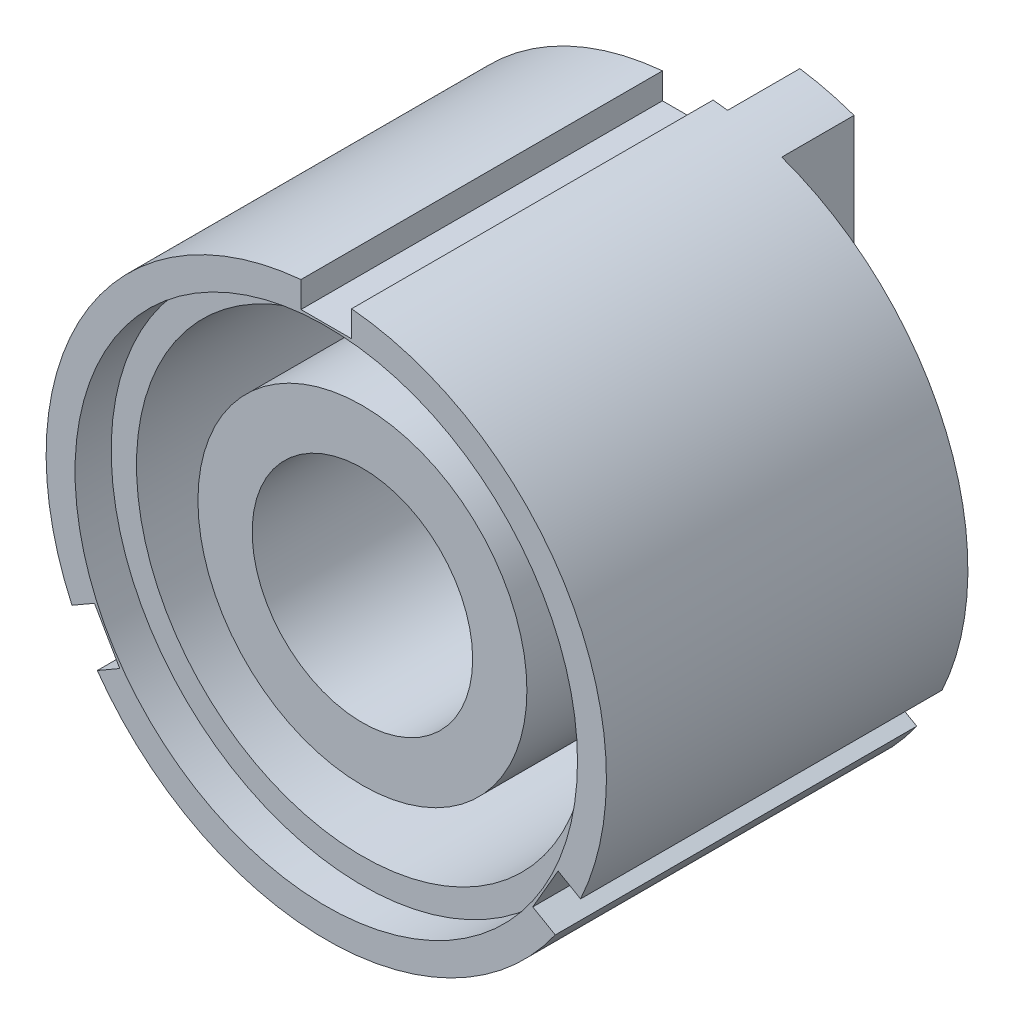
ISO-10303-21;
HEADER;
FILE_DESCRIPTION(('STEP AP214'),'2;1');
FILE_NAME('part.step','',(''),(''),'','','');
FILE_SCHEMA(('AUTOMOTIVE_DESIGN { 1 0 10303 214 1 1 1 1 }'));
ENDSEC;
DATA;
#1=APPLICATION_CONTEXT('core data for automotive mechanical design processes');
#2=APPLICATION_PROTOCOL_DEFINITION('international standard','automotive_design',2000,#1);
#3=PRODUCT_CONTEXT('',#1,'mechanical');
#4=PRODUCT('Part','Part','',(#3));
#5=PRODUCT_RELATED_PRODUCT_CATEGORY('part','',(#4));
#6=PRODUCT_DEFINITION_FORMATION('','',#4);
#7=PRODUCT_DEFINITION_CONTEXT('part definition',#1,'design');
#8=PRODUCT_DEFINITION('design','',#6,#7);
#9=PRODUCT_DEFINITION_SHAPE('','',#8);
#10=(LENGTH_UNIT() NAMED_UNIT(*) SI_UNIT(.MILLI.,.METRE.));
#11=(NAMED_UNIT(*) PLANE_ANGLE_UNIT() SI_UNIT($,.RADIAN.));
#12=(NAMED_UNIT(*) SI_UNIT($,.STERADIAN.) SOLID_ANGLE_UNIT());
#13=UNCERTAINTY_MEASURE_WITH_UNIT(LENGTH_MEASURE(1.E-05),#10,'distance_accuracy_value','');
#14=(GEOMETRIC_REPRESENTATION_CONTEXT(3) GLOBAL_UNCERTAINTY_ASSIGNED_CONTEXT((#13)) GLOBAL_UNIT_ASSIGNED_CONTEXT((#10,
#11,#12)) REPRESENTATION_CONTEXT('',''));
#15=CARTESIAN_POINT('',(0.,0.,0.));
#16=DIRECTION('',(0.,0.,1.));
#17=DIRECTION('',(1.,0.,0.));
#18=AXIS2_PLACEMENT_3D('',#15,#16,#17);
#19=CARTESIAN_POINT('',(0.,0.,0.));
#20=DIRECTION('',(0.,0.,1.));
#21=DIRECTION('',(1.,0.,0.));
#22=AXIS2_PLACEMENT_3D('',#19,#20,#21);
#23=PLANE('',#22);
#24=CARTESIAN_POINT('',(0.,0.,0.));
#25=DIRECTION('',(0.,0.,1.));
#26=DIRECTION('',(1.,0.,0.));
#27=AXIS2_PLACEMENT_3D('',#24,#25,#26);
#28=CIRCLE('',#27,3.05);
#29=CARTESIAN_POINT('',(3.05,0.,0.));
#30=VERTEX_POINT('',#29);
#31=EDGE_CURVE('E200',#30,#30,#28,.T.);
#32=ORIENTED_EDGE('',*,*,#31,.T.);
#33=EDGE_LOOP('',(#32));
#34=FACE_BOUND('',#33,.T.);
#35=DIRECTION('',(0.,1.,0.));
#36=VECTOR('',#35,1.);
#37=CARTESIAN_POINT('',(-2.60000000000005,-7.30085611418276,0.));
#38=LINE('',#37,#36);
#39=CARTESIAN_POINT('',(-2.60000000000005,-7.30085611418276,0.));
#40=VERTEX_POINT('',#39);
#41=CARTESIAN_POINT('',(-2.60000000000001,-1.6881943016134,0.));
#42=VERTEX_POINT('',#41);
#43=EDGE_CURVE('E174',#40,#42,#38,.T.);
#44=ORIENTED_EDGE('',*,*,#43,.F.);
#45=CARTESIAN_POINT('',(0.,0.,0.));
#46=DIRECTION('',(0.,0.,1.));
#47=DIRECTION('',(1.,0.,0.));
#48=AXIS2_PLACEMENT_3D('',#45,#46,#47);
#49=CIRCLE('',#48,7.75);
#50=CARTESIAN_POINT('',(-6.33426323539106,-4.46537896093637,0.));
#51=VERTEX_POINT('',#50);
#52=EDGE_CURVE('E185',#51,#40,#49,.T.);
#53=ORIENTED_EDGE('',*,*,#52,.F.);
#54=DIRECTION('',(0.866025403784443,0.499999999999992,0.));
#55=VECTOR('',#54,1.);
#56=CARTESIAN_POINT('',(-6.33426323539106,-4.46537896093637,0.));
#57=LINE('',#56,#55);
#58=CARTESIAN_POINT('',(-5.71217782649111,-4.10621778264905,0.));
#59=VERTEX_POINT('',#58);
#60=EDGE_CURVE('E415',#51,#59,#57,.T.);
#61=ORIENTED_EDGE('',*,*,#60,.T.);
#62=DIRECTION('',(-0.499999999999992,0.866025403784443,0.));
#63=VECTOR('',#62,1.);
#64=CARTESIAN_POINT('',(-5.71217782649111,-4.10621778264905,0.));
#65=LINE('',#64,#63);
#66=CARTESIAN_POINT('',(-6.4121778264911,-2.89378221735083,0.));
#67=VERTEX_POINT('',#66);
#68=EDGE_CURVE('E417',#59,#67,#65,.T.);
#69=ORIENTED_EDGE('',*,*,#68,.T.);
#70=DIRECTION('',(-0.866025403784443,-0.499999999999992,0.));
#71=VECTOR('',#70,1.);
#72=CARTESIAN_POINT('',(-7.03426323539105,-3.25294339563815,0.));
#73=LINE('',#72,#71);
#74=CARTESIAN_POINT('',(-7.03426323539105,-3.25294339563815,0.));
#75=VERTEX_POINT('',#74);
#76=EDGE_CURVE('E412',#67,#75,#73,.T.);
#77=ORIENTED_EDGE('',*,*,#76,.T.);
#78=CARTESIAN_POINT('',(-0.7,7.71832235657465,0.));
#79=VERTEX_POINT('',#78);
#80=EDGE_CURVE('E193',#79,#75,#49,.T.);
#81=ORIENTED_EDGE('',*,*,#80,.F.);
#82=DIRECTION('',(0.,-1.,0.));
#83=VECTOR('',#82,1.);
#84=CARTESIAN_POINT('',(-0.7,7.71832235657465,0.));
#85=LINE('',#84,#83);
#86=CARTESIAN_POINT('',(-0.7,7.,0.));
#87=VERTEX_POINT('',#86);
#88=EDGE_CURVE('E468',#79,#87,#85,.T.);
#89=ORIENTED_EDGE('',*,*,#88,.T.);
#90=DIRECTION('',(1.,0.,0.));
#91=VECTOR('',#90,1.);
#92=CARTESIAN_POINT('',(-0.7,7.,0.));
#93=LINE('',#92,#91);
#94=CARTESIAN_POINT('',(0.7,7.,0.));
#95=VERTEX_POINT('',#94);
#96=EDGE_CURVE('E471',#87,#95,#93,.T.);
#97=ORIENTED_EDGE('',*,*,#96,.T.);
#98=DIRECTION('',(0.,1.,0.));
#99=VECTOR('',#98,1.);
#100=CARTESIAN_POINT('',(0.7,7.71832235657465,0.));
#101=LINE('',#100,#99);
#102=CARTESIAN_POINT('',(0.700000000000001,7.71832235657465,0.));
#103=VERTEX_POINT('',#102);
#104=EDGE_CURVE('E465',#95,#103,#101,.T.);
#105=ORIENTED_EDGE('',*,*,#104,.T.);
#106=CARTESIAN_POINT('',(1.1,7.6715383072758,0.));
#107=VERTEX_POINT('',#106);
#108=EDGE_CURVE('E205',#107,#103,#49,.T.);
#109=ORIENTED_EDGE('',*,*,#108,.F.);
#110=DIRECTION('',(0.,1.,0.));
#111=VECTOR('',#110,1.);
#112=CARTESIAN_POINT('',(1.1,7.6715383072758,0.));
#113=LINE('',#112,#111);
#114=CARTESIAN_POINT('',(1.1,2.89827534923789,0.));
#115=VERTEX_POINT('',#114);
#116=EDGE_CURVE('E56',#115,#107,#113,.T.);
#117=ORIENTED_EDGE('',*,*,#116,.F.);
#118=CARTESIAN_POINT('',(0.,0.,0.));
#119=DIRECTION('',(0.,0.,1.));
#120=DIRECTION('',(-1.,0.,0.));
#121=AXIS2_PLACEMENT_3D('',#118,#119,#120);
#122=CIRCLE('',#121,3.1);
#123=CARTESIAN_POINT('',(2.6,1.68819430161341,0.));
#124=VERTEX_POINT('',#123);
#125=EDGE_CURVE('E376',#124,#115,#122,.T.);
#126=ORIENTED_EDGE('',*,*,#125,.F.);
#127=DIRECTION('',(0.,-1.,0.));
#128=VECTOR('',#127,1.);
#129=CARTESIAN_POINT('',(2.6,7.30085611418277,0.));
#130=LINE('',#129,#128);
#131=CARTESIAN_POINT('',(2.6,7.30085611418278,0.));
#132=VERTEX_POINT('',#131);
#133=EDGE_CURVE('E179',#132,#124,#130,.T.);
#134=ORIENTED_EDGE('',*,*,#133,.F.);
#135=CARTESIAN_POINT('',(7.034263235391,-3.25294339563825,0.));
#136=VERTEX_POINT('',#135);
#137=EDGE_CURVE('E197',#136,#132,#49,.T.);
#138=ORIENTED_EDGE('',*,*,#137,.F.);
#139=DIRECTION('',(-0.866025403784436,0.500000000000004,0.));
#140=VECTOR('',#139,1.);
#141=CARTESIAN_POINT('',(7.034263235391,-3.25294339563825,0.));
#142=LINE('',#141,#140);
#143=CARTESIAN_POINT('',(6.41217782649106,-2.89378221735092,0.));
#144=VERTEX_POINT('',#143);
#145=EDGE_CURVE('E440',#136,#144,#142,.T.);
#146=ORIENTED_EDGE('',*,*,#145,.T.);
#147=DIRECTION('',(-0.500000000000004,-0.866025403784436,0.));
#148=VECTOR('',#147,1.);
#149=CARTESIAN_POINT('',(6.41217782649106,-2.89378221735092,0.));
#150=LINE('',#149,#148);
#151=CARTESIAN_POINT('',(5.71217782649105,-4.10621778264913,0.));
#152=VERTEX_POINT('',#151);
#153=EDGE_CURVE('E443',#144,#152,#150,.T.);
#154=ORIENTED_EDGE('',*,*,#153,.T.);
#155=DIRECTION('',(0.866025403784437,-0.500000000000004,0.));
#156=VECTOR('',#155,1.);
#157=CARTESIAN_POINT('',(6.334263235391,-4.46537896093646,0.));
#158=LINE('',#157,#156);
#159=CARTESIAN_POINT('',(6.334263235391,-4.46537896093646,0.));
#160=VERTEX_POINT('',#159);
#161=EDGE_CURVE('E437',#152,#160,#158,.T.);
#162=ORIENTED_EDGE('',*,*,#161,.T.);
#163=CARTESIAN_POINT('',(-1.10000000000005,-7.67153830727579,0.));
#164=VERTEX_POINT('',#163);
#165=EDGE_CURVE('E194',#164,#160,#49,.T.);
#166=ORIENTED_EDGE('',*,*,#165,.F.);
#167=DIRECTION('',(0.,-1.,0.));
#168=VECTOR('',#167,1.);
#169=CARTESIAN_POINT('',(-1.10000000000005,-7.67153830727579,0.));
#170=LINE('',#169,#168);
#171=CARTESIAN_POINT('',(-1.10000000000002,-2.89827534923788,0.));
#172=VERTEX_POINT('',#171);
#173=EDGE_CURVE('E362',#172,#164,#170,.T.);
#174=ORIENTED_EDGE('',*,*,#173,.F.);
#175=CARTESIAN_POINT('',(0.,0.,0.));
#176=DIRECTION('',(0.,0.,1.));
#177=DIRECTION('',(1.,0.,0.));
#178=AXIS2_PLACEMENT_3D('',#175,#176,#177);
#179=CIRCLE('',#178,3.1);
#180=EDGE_CURVE('E187',#42,#172,#179,.T.);
#181=ORIENTED_EDGE('',*,*,#180,.F.);
#182=EDGE_LOOP('',(#44,#53,#61,#69,#77,#81,#89,#97,#105,#109,#117,#126,#134,#138,#146,#154,#162,
#166,#174,#181));
#183=FACE_BOUND('',#182,.T.);
#184=ADVANCED_FACE('F29',(#34,#183),#23,.F.);
#185=CARTESIAN_POINT('',(0.,0.,10.));
#186=DIRECTION('',(0.,0.,-1.));
#187=DIRECTION('',(-1.,0.,0.));
#188=AXIS2_PLACEMENT_3D('',#185,#186,#187);
#189=CYLINDRICAL_SURFACE('',#188,7.75);
#190=ORIENTED_EDGE('',*,*,#80,.T.);
#191=DIRECTION('',(0.,0.,1.));
#192=VECTOR('',#191,1.);
#193=CARTESIAN_POINT('',(-7.03426323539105,-3.25294339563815,0.));
#194=LINE('',#193,#192);
#195=CARTESIAN_POINT('',(-7.03426323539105,-3.25294339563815,10.));
#196=VERTEX_POINT('',#195);
#197=EDGE_CURVE('E420',#75,#196,#194,.T.);
#198=ORIENTED_EDGE('',*,*,#197,.T.);
#199=CARTESIAN_POINT('',(0.,0.,10.));
#200=DIRECTION('',(0.,0.,1.));
#201=DIRECTION('',(1.,0.,0.));
#202=AXIS2_PLACEMENT_3D('',#199,#200,#201);
#203=CIRCLE('',#202,7.75);
#204=CARTESIAN_POINT('',(-0.7,7.71832235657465,10.));
#205=VERTEX_POINT('',#204);
#206=EDGE_CURVE('E12',#205,#196,#203,.T.);
#207=ORIENTED_EDGE('',*,*,#206,.F.);
#208=DIRECTION('',(0.,0.,1.));
#209=VECTOR('',#208,1.);
#210=CARTESIAN_POINT('',(-0.7,7.71832235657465,0.));
#211=LINE('',#210,#209);
#212=EDGE_CURVE('E478',#79,#205,#211,.T.);
#213=ORIENTED_EDGE('',*,*,#212,.F.);
#214=EDGE_LOOP('',(#190,#198,#207,#213));
#215=FACE_BOUND('',#214,.T.);
#216=ADVANCED_FACE('F256',(#215),#189,.T.);
#217=CARTESIAN_POINT('',(-6.33426323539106,-4.46537896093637,10.));
#218=VERTEX_POINT('',#217);
#219=CARTESIAN_POINT('',(6.334263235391,-4.46537896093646,10.));
#220=VERTEX_POINT('',#219);
#221=EDGE_CURVE('E39',#218,#220,#203,.T.);
#222=ORIENTED_EDGE('',*,*,#221,.F.);
#223=DIRECTION('',(0.,0.,1.));
#224=VECTOR('',#223,1.);
#225=CARTESIAN_POINT('',(-6.33426323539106,-4.46537896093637,0.));
#226=LINE('',#225,#224);
#227=EDGE_CURVE('E192',#51,#218,#226,.T.);
#228=ORIENTED_EDGE('',*,*,#227,.F.);
#229=ORIENTED_EDGE('',*,*,#52,.T.);
#230=DIRECTION('',(0.,0.,1.));
#231=VECTOR('',#230,1.);
#232=CARTESIAN_POINT('',(-2.60000000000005,-7.30085611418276,-2.));
#233=LINE('',#232,#231);
#234=CARTESIAN_POINT('',(-2.60000000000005,-7.30085611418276,-2.));
#235=VERTEX_POINT('',#234);
#236=EDGE_CURVE('E170',#235,#40,#233,.T.);
#237=ORIENTED_EDGE('',*,*,#236,.F.);
#238=CARTESIAN_POINT('',(0.,0.,-2.));
#239=DIRECTION('',(0.,0.,-1.));
#240=DIRECTION('',(1.,0.,0.));
#241=AXIS2_PLACEMENT_3D('',#238,#239,#240);
#242=CIRCLE('',#241,7.75);
#243=CARTESIAN_POINT('',(-1.10000000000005,-7.67153830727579,-2.));
#244=VERTEX_POINT('',#243);
#245=EDGE_CURVE('E359',#244,#235,#242,.T.);
#246=ORIENTED_EDGE('',*,*,#245,.F.);
#247=DIRECTION('',(0.,0.,1.));
#248=VECTOR('',#247,1.);
#249=CARTESIAN_POINT('',(-1.10000000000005,-7.67153830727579,-2.));
#250=LINE('',#249,#248);
#251=EDGE_CURVE('E48',#244,#164,#250,.T.);
#252=ORIENTED_EDGE('',*,*,#251,.T.);
#253=ORIENTED_EDGE('',*,*,#165,.T.);
#254=DIRECTION('',(0.,0.,1.));
#255=VECTOR('',#254,1.);
#256=CARTESIAN_POINT('',(6.334263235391,-4.46537896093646,0.));
#257=LINE('',#256,#255);
#258=EDGE_CURVE('E446',#160,#220,#257,.T.);
#259=ORIENTED_EDGE('',*,*,#258,.T.);
#260=EDGE_LOOP('',(#222,#228,#229,#237,#246,#252,#253,#259));
#261=FACE_BOUND('',#260,.T.);
#262=ADVANCED_FACE('F191',(#261),#189,.T.);
#263=CARTESIAN_POINT('',(0.,0.,10.));
#264=DIRECTION('',(0.,0.,-1.));
#265=DIRECTION('',(-1.,0.,0.));
#266=AXIS2_PLACEMENT_3D('',#263,#264,#265);
#267=CYLINDRICAL_SURFACE('',#266,3.05);
#268=ORIENTED_EDGE('',*,*,#31,.F.);
#269=EDGE_LOOP('',(#268));
#270=FACE_BOUND('',#269,.T.);
#271=CARTESIAN_POINT('',(0.,0.,9.));
#272=DIRECTION('',(0.,0.,1.));
#273=DIRECTION('',(1.,0.,0.));
#274=AXIS2_PLACEMENT_3D('',#271,#272,#273);
#275=CIRCLE('',#274,3.05);
#276=CARTESIAN_POINT('',(3.05,0.,9.));
#277=VERTEX_POINT('',#276);
#278=EDGE_CURVE('E216',#277,#277,#275,.T.);
#279=ORIENTED_EDGE('',*,*,#278,.T.);
#280=EDGE_LOOP('',(#279));
#281=FACE_BOUND('',#280,.T.);
#282=ADVANCED_FACE('F267',(#270,#281),#267,.F.);
#283=CARTESIAN_POINT('',(0.,0.,10.));
#284=DIRECTION('',(0.,0.,1.));
#285=DIRECTION('',(1.,0.,0.));
#286=AXIS2_PLACEMENT_3D('',#283,#284,#285);
#287=PLANE('',#286);
#288=DIRECTION('',(-0.866025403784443,-0.499999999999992,0.));
#289=VECTOR('',#288,1.);
#290=CARTESIAN_POINT('',(-7.03426323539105,-3.25294339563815,10.));
#291=LINE('',#290,#289);
#292=CARTESIAN_POINT('',(-6.4121778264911,-2.89378221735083,10.));
#293=VERTEX_POINT('',#292);
#294=EDGE_CURVE('E281',#293,#196,#291,.T.);
#295=ORIENTED_EDGE('',*,*,#294,.F.);
#296=DIRECTION('',(-0.499999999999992,0.866025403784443,0.));
#297=VECTOR('',#296,1.);
#298=CARTESIAN_POINT('',(-5.71217782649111,-4.10621778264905,10.));
#299=LINE('',#298,#297);
#300=CARTESIAN_POINT('',(-5.71217782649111,-4.10621778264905,10.));
#301=VERTEX_POINT('',#300);
#302=EDGE_CURVE('E409',#301,#293,#299,.T.);
#303=ORIENTED_EDGE('',*,*,#302,.F.);
#304=DIRECTION('',(0.866025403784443,0.499999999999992,0.));
#305=VECTOR('',#304,1.);
#306=CARTESIAN_POINT('',(-6.33426323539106,-4.46537896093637,10.));
#307=LINE('',#306,#305);
#308=EDGE_CURVE('E406',#218,#301,#307,.T.);
#309=ORIENTED_EDGE('',*,*,#308,.F.);
#310=ORIENTED_EDGE('',*,*,#221,.T.);
#311=DIRECTION('',(0.866025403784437,-0.500000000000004,0.));
#312=VECTOR('',#311,1.);
#313=CARTESIAN_POINT('',(6.334263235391,-4.46537896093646,10.));
#314=LINE('',#313,#312);
#315=CARTESIAN_POINT('',(5.71217782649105,-4.10621778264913,10.));
#316=VERTEX_POINT('',#315);
#317=EDGE_CURVE('E423',#316,#220,#314,.T.);
#318=ORIENTED_EDGE('',*,*,#317,.F.);
#319=DIRECTION('',(-0.500000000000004,-0.866025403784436,0.));
#320=VECTOR('',#319,1.);
#321=CARTESIAN_POINT('',(6.41217782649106,-2.89378221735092,10.));
#322=LINE('',#321,#320);
#323=CARTESIAN_POINT('',(6.41217782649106,-2.89378221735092,10.));
#324=VERTEX_POINT('',#323);
#325=EDGE_CURVE('E434',#324,#316,#322,.T.);
#326=ORIENTED_EDGE('',*,*,#325,.F.);
#327=DIRECTION('',(-0.866025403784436,0.500000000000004,0.));
#328=VECTOR('',#327,1.);
#329=CARTESIAN_POINT('',(7.034263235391,-3.25294339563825,10.));
#330=LINE('',#329,#328);
#331=CARTESIAN_POINT('',(7.034263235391,-3.25294339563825,10.));
#332=VERTEX_POINT('',#331);
#333=EDGE_CURVE('E431',#332,#324,#330,.T.);
#334=ORIENTED_EDGE('',*,*,#333,.F.);
#335=CARTESIAN_POINT('',(0.700000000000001,7.71832235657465,10.));
#336=VERTEX_POINT('',#335);
#337=EDGE_CURVE('E41',#332,#336,#203,.T.);
#338=ORIENTED_EDGE('',*,*,#337,.T.);
#339=DIRECTION('',(0.,1.,0.));
#340=VECTOR('',#339,1.);
#341=CARTESIAN_POINT('',(0.7,7.71832235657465,10.));
#342=LINE('',#341,#340);
#343=CARTESIAN_POINT('',(0.7,7.,10.));
#344=VERTEX_POINT('',#343);
#345=EDGE_CURVE('E449',#344,#336,#342,.T.);
#346=ORIENTED_EDGE('',*,*,#345,.F.);
#347=DIRECTION('',(1.,0.,0.));
#348=VECTOR('',#347,1.);
#349=CARTESIAN_POINT('',(-0.7,7.,10.));
#350=LINE('',#349,#348);
#351=CARTESIAN_POINT('',(-0.7,7.,10.));
#352=VERTEX_POINT('',#351);
#353=EDGE_CURVE('E462',#352,#344,#350,.T.);
#354=ORIENTED_EDGE('',*,*,#353,.F.);
#355=DIRECTION('',(0.,-1.,0.));
#356=VECTOR('',#355,1.);
#357=CARTESIAN_POINT('',(-0.7,7.71832235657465,10.));
#358=LINE('',#357,#356);
#359=EDGE_CURVE('E458',#205,#352,#358,.T.);
#360=ORIENTED_EDGE('',*,*,#359,.F.);
#361=ORIENTED_EDGE('',*,*,#206,.T.);
#362=EDGE_LOOP('',(#295,#303,#309,#310,#318,#326,#334,#338,#346,#354,#360,#361));
#363=FACE_BOUND('',#362,.T.);
#364=CARTESIAN_POINT('',(0.,0.,10.));
#365=DIRECTION('',(0.,0.,1.));
#366=DIRECTION('',(1.,0.,0.));
#367=AXIS2_PLACEMENT_3D('',#364,#365,#366);
#368=CIRCLE('',#367,6.95);
#369=CARTESIAN_POINT('',(6.95,0.,10.));
#370=VERTEX_POINT('',#369);
#371=EDGE_CURVE('E219',#370,#370,#368,.T.);
#372=ORIENTED_EDGE('',*,*,#371,.F.);
#373=EDGE_LOOP('',(#372));
#374=FACE_BOUND('',#373,.T.);
#375=ADVANCED_FACE('F268',(#363,#374),#287,.T.);
#376=ORIENTED_EDGE('',*,*,#337,.F.);
#377=DIRECTION('',(0.,0.,1.));
#378=VECTOR('',#377,1.);
#379=CARTESIAN_POINT('',(7.034263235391,-3.25294339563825,0.));
#380=LINE('',#379,#378);
#381=EDGE_CURVE('E452',#136,#332,#380,.T.);
#382=ORIENTED_EDGE('',*,*,#381,.F.);
#383=ORIENTED_EDGE('',*,*,#137,.T.);
#384=DIRECTION('',(0.,0.,1.));
#385=VECTOR('',#384,1.);
#386=CARTESIAN_POINT('',(2.6,7.30085611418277,-2.));
#387=LINE('',#386,#385);
#388=CARTESIAN_POINT('',(2.6,7.30085611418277,-2.));
#389=VERTEX_POINT('',#388);
#390=EDGE_CURVE('E404',#389,#132,#387,.T.);
#391=ORIENTED_EDGE('',*,*,#390,.F.);
#392=CARTESIAN_POINT('',(0.,0.,-2.));
#393=DIRECTION('',(0.,0.,-1.));
#394=DIRECTION('',(-1.,0.,0.));
#395=AXIS2_PLACEMENT_3D('',#392,#393,#394);
#396=CIRCLE('',#395,7.75);
#397=CARTESIAN_POINT('',(1.1,7.6715383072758,-2.));
#398=VERTEX_POINT('',#397);
#399=EDGE_CURVE('E380',#398,#389,#396,.T.);
#400=ORIENTED_EDGE('',*,*,#399,.F.);
#401=DIRECTION('',(0.,0.,1.));
#402=VECTOR('',#401,1.);
#403=CARTESIAN_POINT('',(1.1,7.6715383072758,-2.));
#404=LINE('',#403,#402);
#405=EDGE_CURVE('E386',#398,#107,#404,.T.);
#406=ORIENTED_EDGE('',*,*,#405,.T.);
#407=ORIENTED_EDGE('',*,*,#108,.T.);
#408=DIRECTION('',(0.,0.,1.));
#409=VECTOR('',#408,1.);
#410=CARTESIAN_POINT('',(0.700000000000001,7.71832235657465,0.));
#411=LINE('',#410,#409);
#412=EDGE_CURVE('E474',#103,#336,#411,.T.);
#413=ORIENTED_EDGE('',*,*,#412,.T.);
#414=EDGE_LOOP('',(#376,#382,#383,#391,#400,#406,#407,#413));
#415=FACE_BOUND('',#414,.T.);
#416=ADVANCED_FACE('F31',(#415),#189,.T.);
#417=CARTESIAN_POINT('',(0.,0.,9.));
#418=DIRECTION('',(0.,0.,1.));
#419=DIRECTION('',(1.,0.,0.));
#420=AXIS2_PLACEMENT_3D('',#417,#418,#419);
#421=PLANE('',#420);
#422=ORIENTED_EDGE('',*,*,#278,.F.);
#423=EDGE_LOOP('',(#422));
#424=FACE_BOUND('',#423,.T.);
#425=CARTESIAN_POINT('',(0.,0.,9.));
#426=DIRECTION('',(0.,0.,1.));
#427=DIRECTION('',(1.,0.,0.));
#428=AXIS2_PLACEMENT_3D('',#425,#426,#427);
#429=CIRCLE('',#428,4.55);
#430=CARTESIAN_POINT('',(4.55,0.,9.));
#431=VERTEX_POINT('',#430);
#432=EDGE_CURVE('E209',#431,#431,#429,.T.);
#433=ORIENTED_EDGE('',*,*,#432,.T.);
#434=EDGE_LOOP('',(#433));
#435=FACE_BOUND('',#434,.T.);
#436=ADVANCED_FACE('F275',(#424,#435),#421,.T.);
#437=CARTESIAN_POINT('',(0.,0.,9.));
#438=DIRECTION('',(0.,0.,1.));
#439=DIRECTION('',(1.,0.,0.));
#440=AXIS2_PLACEMENT_3D('',#437,#438,#439);
#441=CYLINDRICAL_SURFACE('',#440,6.95);
#442=CARTESIAN_POINT('',(0.,0.,9.));
#443=DIRECTION('',(0.,0.,1.));
#444=DIRECTION('',(1.,0.,0.));
#445=AXIS2_PLACEMENT_3D('',#442,#443,#444);
#446=CIRCLE('',#445,6.95);
#447=CARTESIAN_POINT('',(6.95,0.,9.));
#448=VERTEX_POINT('',#447);
#449=EDGE_CURVE('E212',#448,#448,#446,.T.);
#450=ORIENTED_EDGE('',*,*,#449,.F.);
#451=EDGE_LOOP('',(#450));
#452=FACE_BOUND('',#451,.T.);
#453=ORIENTED_EDGE('',*,*,#371,.T.);
#454=EDGE_LOOP('',(#453));
#455=FACE_BOUND('',#454,.T.);
#456=ADVANCED_FACE('F284',(#452,#455),#441,.F.);
#457=CARTESIAN_POINT('',(0.,0.,9.));
#458=DIRECTION('',(0.,0.,1.));
#459=DIRECTION('',(1.,0.,0.));
#460=AXIS2_PLACEMENT_3D('',#457,#458,#459);
#461=CIRCLE('',#460,6.25);
#462=CARTESIAN_POINT('',(6.25,0.,9.));
#463=VERTEX_POINT('',#462);
#464=EDGE_CURVE('E211',#463,#463,#461,.T.);
#465=ORIENTED_EDGE('',*,*,#464,.F.);
#466=EDGE_LOOP('',(#465));
#467=FACE_BOUND('',#466,.T.);
#468=ORIENTED_EDGE('',*,*,#449,.T.);
#469=EDGE_LOOP('',(#468));
#470=FACE_BOUND('',#469,.T.);
#471=ADVANCED_FACE('F251',(#467,#470),#421,.T.);
#472=CARTESIAN_POINT('',(0.,0.,10.));
#473=DIRECTION('',(0.,0.,-1.));
#474=DIRECTION('',(-1.,0.,0.));
#475=AXIS2_PLACEMENT_3D('',#472,#473,#474);
#476=CYLINDRICAL_SURFACE('',#475,6.25);
#477=CARTESIAN_POINT('',(0.,0.,1.5));
#478=DIRECTION('',(0.,0.,1.));
#479=DIRECTION('',(1.,0.,0.));
#480=AXIS2_PLACEMENT_3D('',#477,#478,#479);
#481=CIRCLE('',#480,6.25);
#482=CARTESIAN_POINT('',(6.25,0.,1.5));
#483=VERTEX_POINT('',#482);
#484=EDGE_CURVE('E231',#483,#483,#481,.T.);
#485=ORIENTED_EDGE('',*,*,#484,.F.);
#486=EDGE_LOOP('',(#485));
#487=FACE_BOUND('',#486,.T.);
#488=ORIENTED_EDGE('',*,*,#464,.T.);
#489=EDGE_LOOP('',(#488));
#490=FACE_BOUND('',#489,.T.);
#491=ADVANCED_FACE('F241',(#487,#490),#476,.F.);
#492=CARTESIAN_POINT('',(0.,0.,1.5));
#493=DIRECTION('',(0.,0.,1.));
#494=DIRECTION('',(1.,0.,0.));
#495=AXIS2_PLACEMENT_3D('',#492,#493,#494);
#496=PLANE('',#495);
#497=ORIENTED_EDGE('',*,*,#484,.T.);
#498=EDGE_LOOP('',(#497));
#499=FACE_BOUND('',#498,.T.);
#500=CARTESIAN_POINT('',(0.,0.,1.5));
#501=DIRECTION('',(0.,0.,1.));
#502=DIRECTION('',(1.,0.,0.));
#503=AXIS2_PLACEMENT_3D('',#500,#501,#502);
#504=CIRCLE('',#503,4.55);
#505=CARTESIAN_POINT('',(4.55,0.,1.5));
#506=VERTEX_POINT('',#505);
#507=EDGE_CURVE('E230',#506,#506,#504,.T.);
#508=ORIENTED_EDGE('',*,*,#507,.F.);
#509=EDGE_LOOP('',(#508));
#510=FACE_BOUND('',#509,.T.);
#511=ADVANCED_FACE('F239',(#499,#510),#496,.T.);
#512=CARTESIAN_POINT('',(0.,0.,10.));
#513=DIRECTION('',(0.,0.,-1.));
#514=DIRECTION('',(-1.,0.,0.));
#515=AXIS2_PLACEMENT_3D('',#512,#513,#514);
#516=CYLINDRICAL_SURFACE('',#515,4.55);
#517=ORIENTED_EDGE('',*,*,#507,.T.);
#518=EDGE_LOOP('',(#517));
#519=FACE_BOUND('',#518,.T.);
#520=ORIENTED_EDGE('',*,*,#432,.F.);
#521=EDGE_LOOP('',(#520));
#522=FACE_BOUND('',#521,.T.);
#523=ADVANCED_FACE('F236',(#519,#522),#516,.T.);
#524=CARTESIAN_POINT('',(0.7,7.71832235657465,0.));
#525=DIRECTION('',(1.,0.,0.));
#526=DIRECTION('',(0.,1.,0.));
#527=AXIS2_PLACEMENT_3D('',#524,#525,#526);
#528=PLANE('',#527);
#529=ORIENTED_EDGE('',*,*,#345,.T.);
#530=ORIENTED_EDGE('',*,*,#412,.F.);
#531=ORIENTED_EDGE('',*,*,#104,.F.);
#532=DIRECTION('',(0.,0.,1.));
#533=VECTOR('',#532,1.);
#534=CARTESIAN_POINT('',(0.7,7.,0.));
#535=LINE('',#534,#533);
#536=EDGE_CURVE('E224',#95,#344,#535,.T.);
#537=ORIENTED_EDGE('',*,*,#536,.T.);
#538=EDGE_LOOP('',(#529,#530,#531,#537));
#539=FACE_BOUND('',#538,.T.);
#540=ADVANCED_FACE('F248',(#539),#528,.F.);
#541=CARTESIAN_POINT('',(-0.7,7.,0.));
#542=DIRECTION('',(0.,-1.,0.));
#543=DIRECTION('',(0.,0.,-1.));
#544=AXIS2_PLACEMENT_3D('',#541,#542,#543);
#545=PLANE('',#544);
#546=ORIENTED_EDGE('',*,*,#353,.T.);
#547=ORIENTED_EDGE('',*,*,#536,.F.);
#548=ORIENTED_EDGE('',*,*,#96,.F.);
#549=DIRECTION('',(0.,0.,1.));
#550=VECTOR('',#549,1.);
#551=CARTESIAN_POINT('',(-0.7,7.,0.));
#552=LINE('',#551,#550);
#553=EDGE_CURVE('E476',#87,#352,#552,.T.);
#554=ORIENTED_EDGE('',*,*,#553,.T.);
#555=EDGE_LOOP('',(#546,#547,#548,#554));
#556=FACE_BOUND('',#555,.T.);
#557=ADVANCED_FACE('F297',(#556),#545,.F.);
#558=CARTESIAN_POINT('',(-0.7,7.71832235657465,0.));
#559=DIRECTION('',(-1.,0.,0.));
#560=DIRECTION('',(0.,-1.,0.));
#561=AXIS2_PLACEMENT_3D('',#558,#559,#560);
#562=PLANE('',#561);
#563=ORIENTED_EDGE('',*,*,#359,.T.);
#564=ORIENTED_EDGE('',*,*,#553,.F.);
#565=ORIENTED_EDGE('',*,*,#88,.F.);
#566=ORIENTED_EDGE('',*,*,#212,.T.);
#567=EDGE_LOOP('',(#563,#564,#565,#566));
#568=FACE_BOUND('',#567,.T.);
#569=ADVANCED_FACE('F299',(#568),#562,.F.);
#570=CARTESIAN_POINT('',(6.334263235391,-4.46537896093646,0.));
#571=DIRECTION('',(-0.500000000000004,-0.866025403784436,0.));
#572=DIRECTION('',(0.866025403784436,-0.500000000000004,0.));
#573=AXIS2_PLACEMENT_3D('',#570,#571,#572);
#574=PLANE('',#573);
#575=ORIENTED_EDGE('',*,*,#317,.T.);
#576=ORIENTED_EDGE('',*,*,#258,.F.);
#577=ORIENTED_EDGE('',*,*,#161,.F.);
#578=DIRECTION('',(0.,0.,1.));
#579=VECTOR('',#578,1.);
#580=CARTESIAN_POINT('',(5.71217782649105,-4.10621778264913,0.));
#581=LINE('',#580,#579);
#582=EDGE_CURVE('E447',#152,#316,#581,.T.);
#583=ORIENTED_EDGE('',*,*,#582,.T.);
#584=EDGE_LOOP('',(#575,#576,#577,#583));
#585=FACE_BOUND('',#584,.T.);
#586=ADVANCED_FACE('F302',(#585),#574,.F.);
#587=CARTESIAN_POINT('',(6.41217782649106,-2.89378221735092,0.));
#588=DIRECTION('',(-0.866025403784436,0.500000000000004,0.));
#589=DIRECTION('',(-0.500000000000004,-0.866025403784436,0.));
#590=AXIS2_PLACEMENT_3D('',#587,#588,#589);
#591=PLANE('',#590);
#592=ORIENTED_EDGE('',*,*,#325,.T.);
#593=ORIENTED_EDGE('',*,*,#582,.F.);
#594=ORIENTED_EDGE('',*,*,#153,.F.);
#595=DIRECTION('',(0.,0.,1.));
#596=VECTOR('',#595,1.);
#597=CARTESIAN_POINT('',(6.41217782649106,-2.89378221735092,0.));
#598=LINE('',#597,#596);
#599=EDGE_CURVE('E450',#144,#324,#598,.T.);
#600=ORIENTED_EDGE('',*,*,#599,.T.);
#601=EDGE_LOOP('',(#592,#593,#594,#600));
#602=FACE_BOUND('',#601,.T.);
#603=ADVANCED_FACE('F308',(#602),#591,.F.);
#604=CARTESIAN_POINT('',(7.034263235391,-3.25294339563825,0.));
#605=DIRECTION('',(0.500000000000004,0.866025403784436,0.));
#606=DIRECTION('',(-0.866025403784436,0.500000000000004,0.));
#607=AXIS2_PLACEMENT_3D('',#604,#605,#606);
#608=PLANE('',#607);
#609=ORIENTED_EDGE('',*,*,#333,.T.);
#610=ORIENTED_EDGE('',*,*,#599,.F.);
#611=ORIENTED_EDGE('',*,*,#145,.F.);
#612=ORIENTED_EDGE('',*,*,#381,.T.);
#613=EDGE_LOOP('',(#609,#610,#611,#612));
#614=FACE_BOUND('',#613,.T.);
#615=ADVANCED_FACE('F310',(#614),#608,.F.);
#616=CARTESIAN_POINT('',(-7.03426323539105,-3.25294339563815,0.));
#617=DIRECTION('',(-0.499999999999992,0.866025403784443,0.));
#618=DIRECTION('',(-0.866025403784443,-0.499999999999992,0.));
#619=AXIS2_PLACEMENT_3D('',#616,#617,#618);
#620=PLANE('',#619);
#621=ORIENTED_EDGE('',*,*,#294,.T.);
#622=ORIENTED_EDGE('',*,*,#197,.F.);
#623=ORIENTED_EDGE('',*,*,#76,.F.);
#624=DIRECTION('',(0.,0.,1.));
#625=VECTOR('',#624,1.);
#626=CARTESIAN_POINT('',(-6.4121778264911,-2.89378221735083,0.));
#627=LINE('',#626,#625);
#628=EDGE_CURVE('E421',#67,#293,#627,.T.);
#629=ORIENTED_EDGE('',*,*,#628,.T.);
#630=EDGE_LOOP('',(#621,#622,#623,#629));
#631=FACE_BOUND('',#630,.T.);
#632=ADVANCED_FACE('F313',(#631),#620,.F.);
#633=CARTESIAN_POINT('',(-5.71217782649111,-4.10621778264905,0.));
#634=DIRECTION('',(0.866025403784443,0.499999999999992,0.));
#635=DIRECTION('',(-0.499999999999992,0.866025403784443,0.));
#636=AXIS2_PLACEMENT_3D('',#633,#634,#635);
#637=PLANE('',#636);
#638=ORIENTED_EDGE('',*,*,#302,.T.);
#639=ORIENTED_EDGE('',*,*,#628,.F.);
#640=ORIENTED_EDGE('',*,*,#68,.F.);
#641=DIRECTION('',(0.,0.,1.));
#642=VECTOR('',#641,1.);
#643=CARTESIAN_POINT('',(-5.71217782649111,-4.10621778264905,0.));
#644=LINE('',#643,#642);
#645=EDGE_CURVE('E424',#59,#301,#644,.T.);
#646=ORIENTED_EDGE('',*,*,#645,.T.);
#647=EDGE_LOOP('',(#638,#639,#640,#646));
#648=FACE_BOUND('',#647,.T.);
#649=ADVANCED_FACE('F320',(#648),#637,.F.);
#650=CARTESIAN_POINT('',(-6.33426323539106,-4.46537896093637,0.));
#651=DIRECTION('',(0.499999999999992,-0.866025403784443,0.));
#652=DIRECTION('',(0.866025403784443,0.499999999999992,0.));
#653=AXIS2_PLACEMENT_3D('',#650,#651,#652);
#654=PLANE('',#653);
#655=ORIENTED_EDGE('',*,*,#308,.T.);
#656=ORIENTED_EDGE('',*,*,#645,.F.);
#657=ORIENTED_EDGE('',*,*,#60,.F.);
#658=ORIENTED_EDGE('',*,*,#227,.T.);
#659=EDGE_LOOP('',(#655,#656,#657,#658));
#660=FACE_BOUND('',#659,.T.);
#661=ADVANCED_FACE('F322',(#660),#654,.F.);
#662=CARTESIAN_POINT('',(2.6,7.30085611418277,-2.));
#663=DIRECTION('',(-1.,0.,0.));
#664=DIRECTION('',(0.,-1.,0.));
#665=AXIS2_PLACEMENT_3D('',#662,#663,#664);
#666=PLANE('',#665);
#667=ORIENTED_EDGE('',*,*,#133,.T.);
#668=DIRECTION('',(0.,0.,1.));
#669=VECTOR('',#668,1.);
#670=CARTESIAN_POINT('',(2.6,1.68819430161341,-2.));
#671=LINE('',#670,#669);
#672=CARTESIAN_POINT('',(2.6,1.68819430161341,-2.));
#673=VERTEX_POINT('',#672);
#674=EDGE_CURVE('E393',#673,#124,#671,.T.);
#675=ORIENTED_EDGE('',*,*,#674,.F.);
#676=DIRECTION('',(0.,-1.,0.));
#677=VECTOR('',#676,1.);
#678=CARTESIAN_POINT('',(2.6,7.30085611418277,-2.));
#679=LINE('',#678,#677);
#680=EDGE_CURVE('E399',#389,#673,#679,.T.);
#681=ORIENTED_EDGE('',*,*,#680,.F.);
#682=ORIENTED_EDGE('',*,*,#390,.T.);
#683=EDGE_LOOP('',(#667,#675,#681,#682));
#684=FACE_BOUND('',#683,.T.);
#685=ADVANCED_FACE('F325',(#684),#666,.F.);
#686=CARTESIAN_POINT('',(0.,0.,-2.));
#687=DIRECTION('',(0.,0.,1.));
#688=DIRECTION('',(1.,0.,0.));
#689=AXIS2_PLACEMENT_3D('',#686,#687,#688);
#690=CYLINDRICAL_SURFACE('',#689,3.1);
#691=ORIENTED_EDGE('',*,*,#125,.T.);
#692=DIRECTION('',(0.,0.,1.));
#693=VECTOR('',#692,1.);
#694=CARTESIAN_POINT('',(1.1,2.89827534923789,-2.));
#695=LINE('',#694,#693);
#696=CARTESIAN_POINT('',(1.1,2.89827534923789,-2.));
#697=VERTEX_POINT('',#696);
#698=EDGE_CURVE('E388',#697,#115,#695,.T.);
#699=ORIENTED_EDGE('',*,*,#698,.F.);
#700=CARTESIAN_POINT('',(0.,0.,-2.));
#701=DIRECTION('',(0.,0.,1.));
#702=DIRECTION('',(-1.,0.,0.));
#703=AXIS2_PLACEMENT_3D('',#700,#701,#702);
#704=CIRCLE('',#703,3.1);
#705=EDGE_CURVE('E395',#673,#697,#704,.T.);
#706=ORIENTED_EDGE('',*,*,#705,.F.);
#707=ORIENTED_EDGE('',*,*,#674,.T.);
#708=EDGE_LOOP('',(#691,#699,#706,#707));
#709=FACE_BOUND('',#708,.T.);
#710=ADVANCED_FACE('F332',(#709),#690,.F.);
#711=CARTESIAN_POINT('',(1.1,7.6715383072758,-2.));
#712=DIRECTION('',(1.,0.,0.));
#713=DIRECTION('',(0.,1.,0.));
#714=AXIS2_PLACEMENT_3D('',#711,#712,#713);
#715=PLANE('',#714);
#716=ORIENTED_EDGE('',*,*,#116,.T.);
#717=ORIENTED_EDGE('',*,*,#405,.F.);
#718=DIRECTION('',(0.,1.,0.));
#719=VECTOR('',#718,1.);
#720=CARTESIAN_POINT('',(1.1,7.6715383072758,-2.));
#721=LINE('',#720,#719);
#722=EDGE_CURVE('E389',#697,#398,#721,.T.);
#723=ORIENTED_EDGE('',*,*,#722,.F.);
#724=ORIENTED_EDGE('',*,*,#698,.T.);
#725=EDGE_LOOP('',(#716,#717,#723,#724));
#726=FACE_BOUND('',#725,.T.);
#727=ADVANCED_FACE('F336',(#726),#715,.F.);
#728=CARTESIAN_POINT('',(0.,0.,-2.));
#729=DIRECTION('',(0.,0.,-1.));
#730=DIRECTION('',(-1.,0.,0.));
#731=AXIS2_PLACEMENT_3D('',#728,#729,#730);
#732=PLANE('',#731);
#733=ORIENTED_EDGE('',*,*,#399,.T.);
#734=ORIENTED_EDGE('',*,*,#680,.T.);
#735=ORIENTED_EDGE('',*,*,#705,.T.);
#736=ORIENTED_EDGE('',*,*,#722,.T.);
#737=EDGE_LOOP('',(#733,#734,#735,#736));
#738=FACE_BOUND('',#737,.T.);
#739=ADVANCED_FACE('F340',(#738),#732,.T.);
#740=CARTESIAN_POINT('',(-2.60000000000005,-7.30085611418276,-2.));
#741=DIRECTION('',(1.,0.,0.));
#742=DIRECTION('',(0.,1.,0.));
#743=AXIS2_PLACEMENT_3D('',#740,#741,#742);
#744=PLANE('',#743);
#745=ORIENTED_EDGE('',*,*,#43,.T.);
#746=DIRECTION('',(0.,0.,1.));
#747=VECTOR('',#746,1.);
#748=CARTESIAN_POINT('',(-2.60000000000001,-1.6881943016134,-2.));
#749=LINE('',#748,#747);
#750=CARTESIAN_POINT('',(-2.60000000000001,-1.6881943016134,-2.));
#751=VERTEX_POINT('',#750);
#752=EDGE_CURVE('E180',#751,#42,#749,.T.);
#753=ORIENTED_EDGE('',*,*,#752,.F.);
#754=DIRECTION('',(0.,1.,0.));
#755=VECTOR('',#754,1.);
#756=CARTESIAN_POINT('',(-2.60000000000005,-7.30085611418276,-2.));
#757=LINE('',#756,#755);
#758=EDGE_CURVE('E176',#235,#751,#757,.T.);
#759=ORIENTED_EDGE('',*,*,#758,.F.);
#760=ORIENTED_EDGE('',*,*,#236,.T.);
#761=EDGE_LOOP('',(#745,#753,#759,#760));
#762=FACE_BOUND('',#761,.T.);
#763=ADVANCED_FACE('F172',(#762),#744,.F.);
#764=CARTESIAN_POINT('',(0.,0.,-2.));
#765=DIRECTION('',(0.,0.,1.));
#766=DIRECTION('',(1.,0.,0.));
#767=AXIS2_PLACEMENT_3D('',#764,#765,#766);
#768=CYLINDRICAL_SURFACE('',#767,3.1);
#769=ORIENTED_EDGE('',*,*,#180,.T.);
#770=DIRECTION('',(0.,0.,1.));
#771=VECTOR('',#770,1.);
#772=CARTESIAN_POINT('',(-1.10000000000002,-2.89827534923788,-2.));
#773=LINE('',#772,#771);
#774=CARTESIAN_POINT('',(-1.10000000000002,-2.89827534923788,-2.));
#775=VERTEX_POINT('',#774);
#776=EDGE_CURVE('E372',#775,#172,#773,.T.);
#777=ORIENTED_EDGE('',*,*,#776,.F.);
#778=CARTESIAN_POINT('',(0.,0.,-2.));
#779=DIRECTION('',(0.,0.,1.));
#780=DIRECTION('',(1.,0.,0.));
#781=AXIS2_PLACEMENT_3D('',#778,#779,#780);
#782=CIRCLE('',#781,3.1);
#783=EDGE_CURVE('E364',#751,#775,#782,.T.);
#784=ORIENTED_EDGE('',*,*,#783,.F.);
#785=ORIENTED_EDGE('',*,*,#752,.T.);
#786=EDGE_LOOP('',(#769,#777,#784,#785));
#787=FACE_BOUND('',#786,.T.);
#788=ADVANCED_FACE('F346',(#787),#768,.F.);
#789=CARTESIAN_POINT('',(-1.10000000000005,-7.67153830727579,-2.));
#790=DIRECTION('',(-1.,0.,0.));
#791=DIRECTION('',(0.,-1.,0.));
#792=AXIS2_PLACEMENT_3D('',#789,#790,#791);
#793=PLANE('',#792);
#794=ORIENTED_EDGE('',*,*,#173,.T.);
#795=ORIENTED_EDGE('',*,*,#251,.F.);
#796=DIRECTION('',(0.,-1.,0.));
#797=VECTOR('',#796,1.);
#798=CARTESIAN_POINT('',(-1.10000000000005,-7.67153830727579,-2.));
#799=LINE('',#798,#797);
#800=EDGE_CURVE('E361',#775,#244,#799,.T.);
#801=ORIENTED_EDGE('',*,*,#800,.F.);
#802=ORIENTED_EDGE('',*,*,#776,.T.);
#803=EDGE_LOOP('',(#794,#795,#801,#802));
#804=FACE_BOUND('',#803,.T.);
#805=ADVANCED_FACE('F349',(#804),#793,.F.);
#806=CARTESIAN_POINT('',(0.,0.,-2.));
#807=DIRECTION('',(0.,0.,-1.));
#808=DIRECTION('',(1.,0.,0.));
#809=AXIS2_PLACEMENT_3D('',#806,#807,#808);
#810=PLANE('',#809);
#811=ORIENTED_EDGE('',*,*,#245,.T.);
#812=ORIENTED_EDGE('',*,*,#758,.T.);
#813=ORIENTED_EDGE('',*,*,#783,.T.);
#814=ORIENTED_EDGE('',*,*,#800,.T.);
#815=EDGE_LOOP('',(#811,#812,#813,#814));
#816=FACE_BOUND('',#815,.T.);
#817=ADVANCED_FACE('F353',(#816),#810,.T.);
#818=CLOSED_SHELL('',(#184,#216,#262,#282,#375,#416,#436,#456,#471,#491,#511,#523,#540,#557,
#569,#586,#603,#615,#632,#649,#661,#685,#710,#727,#739,#763,#788,#805,#817));
#819=MANIFOLD_SOLID_BREP('B2',#818);
#820=ADVANCED_BREP_SHAPE_REPRESENTATION('',(#18,#819),#14);
#821=SHAPE_DEFINITION_REPRESENTATION(#9,#820);
ENDSEC;
END-ISO-10303-21;
